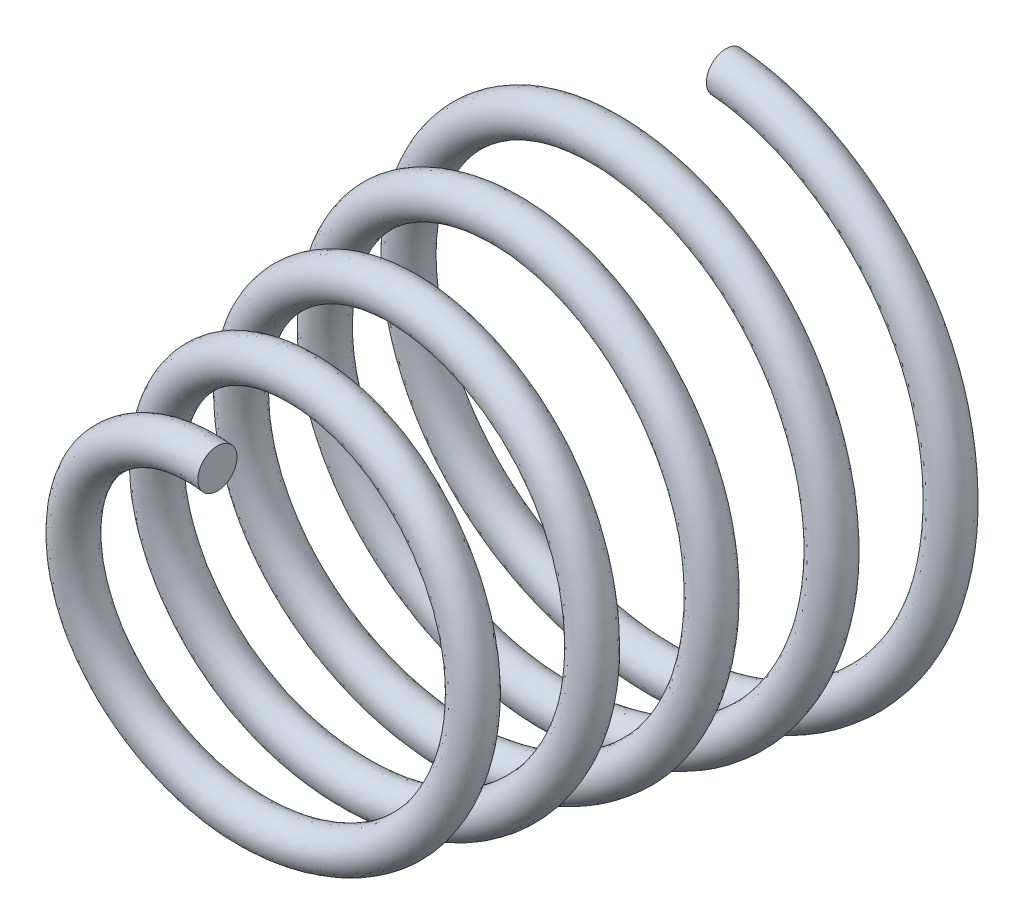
ISO-10303-21;
HEADER;
FILE_DESCRIPTION(('STEP AP214'),'2;1');
FILE_NAME('part.step','',(''),(''),'','','');
FILE_SCHEMA(('AUTOMOTIVE_DESIGN { 1 0 10303 214 1 1 1 1 }'));
ENDSEC;
DATA;
#1=APPLICATION_CONTEXT('core data for automotive mechanical design processes');
#2=APPLICATION_PROTOCOL_DEFINITION('international standard','automotive_design',2000,#1);
#3=PRODUCT_CONTEXT('',#1,'mechanical');
#4=PRODUCT('Part','Part','',(#3));
#5=PRODUCT_RELATED_PRODUCT_CATEGORY('part','',(#4));
#6=PRODUCT_DEFINITION_FORMATION('','',#4);
#7=PRODUCT_DEFINITION_CONTEXT('part definition',#1,'design');
#8=PRODUCT_DEFINITION('design','',#6,#7);
#9=PRODUCT_DEFINITION_SHAPE('','',#8);
#10=(LENGTH_UNIT() NAMED_UNIT(*) SI_UNIT(.MILLI.,.METRE.));
#11=(NAMED_UNIT(*) PLANE_ANGLE_UNIT() SI_UNIT($,.RADIAN.));
#12=(NAMED_UNIT(*) SI_UNIT($,.STERADIAN.) SOLID_ANGLE_UNIT());
#13=UNCERTAINTY_MEASURE_WITH_UNIT(LENGTH_MEASURE(1.E-05),#10,'distance_accuracy_value','');
#14=(GEOMETRIC_REPRESENTATION_CONTEXT(3) GLOBAL_UNCERTAINTY_ASSIGNED_CONTEXT((#13)) GLOBAL_UNIT_ASSIGNED_CONTEXT((#10,
#11,#12)) REPRESENTATION_CONTEXT('',''));
#15=CARTESIAN_POINT('',(0.,0.,0.));
#16=DIRECTION('',(0.,0.,1.));
#17=DIRECTION('',(1.,0.,0.));
#18=AXIS2_PLACEMENT_3D('',#15,#16,#17);
#19=CARTESIAN_POINT('',(0.,3.25116537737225,0.000122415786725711));
#20=DIRECTION('',(1.,0.,0.));
#21=DIRECTION('',(0.,0.,-1.));
#22=AXIS2_PLACEMENT_3D('',#19,#20,#21);
#23=PLANE('',#22);
#24=CARTESIAN_POINT('',(0.,3.25116537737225,0.000122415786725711));
#25=DIRECTION('',(1.,0.,0.));
#26=DIRECTION('',(0.,0.,-1.));
#27=AXIS2_PLACEMENT_3D('',#24,#25,#26);
#28=CIRCLE('',#27,0.25);
#29=CARTESIAN_POINT('',(0.,3.25116537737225,-0.249877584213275));
#30=VERTEX_POINT('',#29);
#31=EDGE_CURVE('E42',#30,#30,#28,.T.);
#32=ORIENTED_EDGE('',*,*,#31,.F.);
#33=EDGE_LOOP('',(#32));
#34=FACE_BOUND('',#33,.T.);
#35=ADVANCED_FACE('F32',(#34),#23,.F.);
#36=CARTESIAN_POINT('',(1.50995920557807E-13,2.10504000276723,6.50012241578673));
#37=DIRECTION('',(1.,0.,0.));
#38=DIRECTION('',(0.,0.,-1.));
#39=AXIS2_PLACEMENT_3D('',#36,#37,#38);
#40=PLANE('',#39);
#41=CARTESIAN_POINT('',(1.50995920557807E-13,2.10504000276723,6.50012241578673));
#42=DIRECTION('',(1.,0.,0.));
#43=DIRECTION('',(0.,0.,-1.));
#44=AXIS2_PLACEMENT_3D('',#41,#42,#43);
#45=CIRCLE('',#44,0.25);
#46=CARTESIAN_POINT('',(1.50995920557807E-13,2.10504000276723,6.25012241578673));
#47=VERTEX_POINT('',#46);
#48=EDGE_CURVE('E11',#47,#47,#45,.T.);
#49=ORIENTED_EDGE('',*,*,#48,.T.);
#50=EDGE_LOOP('',(#49));
#51=FACE_BOUND('',#50,.T.);
#52=ADVANCED_FACE('F49',(#51),#40,.T.);
#53=CARTESIAN_POINT('',(0.,3.25116537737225,-0.249877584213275));
#54=CARTESIAN_POINT('',(1.06394966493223,3.23922626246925,-0.182169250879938));
#55=CARTESIAN_POINT('',(2.09881148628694,2.6678708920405,-0.114460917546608));
#56=CARTESIAN_POINT('',(3.24811841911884,0.904833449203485,0.0209557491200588));
#57=CARTESIAN_POINT('',(3.34671533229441,-0.260030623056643,0.088664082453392));
#58=CARTESIAN_POINT('',(2.52829474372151,-2.17347822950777,0.224080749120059));
#59=CARTESIAN_POINT('',(1.62464478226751,-2.89431578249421,0.291789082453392));
#60=CARTESIAN_POINT('',(-0.398027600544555,-3.27230521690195,0.427205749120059));
#61=CARTESIAN_POINT('',(-1.48689320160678,-2.92522453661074,0.494914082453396));
#62=CARTESIAN_POINT('',(-2.90834071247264,-1.4700093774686,0.630330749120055));
#63=CARTESIAN_POINT('',(-3.22089407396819,-0.384352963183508,0.698039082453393));
#64=CARTESIAN_POINT('',(-2.8052140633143,1.58302039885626,0.833455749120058));
#65=CARTESIAN_POINT('',(-2.0844756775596,2.43593580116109,0.901164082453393));
#66=CARTESIAN_POINT('',(-0.239382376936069,3.17435383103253,1.03658074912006));
#67=CARTESIAN_POINT('',(0.857180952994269,3.05021958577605,1.10428908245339));
#68=CARTESIAN_POINT('',(2.47674096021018,1.93934716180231,1.23970574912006));
#69=CARTESIAN_POINT('',(2.97657270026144,0.970170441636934,1.3074140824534));
#70=CARTESIAN_POINT('',(2.95269536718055,-0.970170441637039,1.44283074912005));
#71=CARTESIAN_POINT('',(2.43071836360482,-1.91266342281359,1.51053908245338));
#72=CARTESIAN_POINT('',(0.823609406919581,-2.95778227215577,1.64595574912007));
#73=CARTESIAN_POINT('',(-0.237009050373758,-3.04611188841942,1.71366408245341));
#74=CARTESIAN_POINT('',(-1.97719820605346,-2.29945729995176,1.84908074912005));
#75=CARTESIAN_POINT('',(-2.63158305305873,-1.47678019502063,1.91678908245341));
#76=CARTESIAN_POINT('',(-2.97298649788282,0.361961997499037,2.05220574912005));
#77=CARTESIAN_POINT('',(-2.65631314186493,1.350588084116,2.11991408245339));
#78=CARTESIAN_POINT('',(-1.33370425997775,2.6394293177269,2.25533074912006));
#79=CARTESIAN_POINT('',(-0.348287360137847,2.92157535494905,2.32303908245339));
#80=CARTESIAN_POINT('',(1.43515581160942,2.5424813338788,2.45845574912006));
#81=CARTESIAN_POINT('',(2.20709835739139,1.88819565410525,2.52616408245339));
#82=CARTESIAN_POINT('',(2.87375038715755,0.216360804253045,2.66158074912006));
#83=CARTESIAN_POINT('',(2.75988343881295,-0.775956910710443,2.72928908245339));
#84=CARTESIAN_POINT('',(1.75319909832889,-2.23958843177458,2.86470574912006));
#85=CARTESIAN_POINT('',(0.876403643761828,-2.6900413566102,2.93241408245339));
#86=CARTESIAN_POINT('',(-0.876403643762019,-2.66616402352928,3.06783074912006));
#87=CARTESIAN_POINT('',(-1.72651535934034,-2.19356583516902,3.13553908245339));
#88=CARTESIAN_POINT('',(-2.66744612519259,-0.742385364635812,3.27095574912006));
#89=CARTESIAN_POINT('',(-2.74550844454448,0.213987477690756,3.33866408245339));
#90=CARTESIAN_POINT('',(-2.07061985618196,1.78091818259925,3.47408074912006));
#91=CARTESIAN_POINT('',(-1.32891560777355,2.36885032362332,3.54178908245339));
#92=CARTESIAN_POINT('',(0.325896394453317,2.67366777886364,3.67720574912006));
#93=CARTESIAN_POINT('',(1.21428296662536,2.38740174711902,3.74491408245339));
#94=CARTESIAN_POINT('',(2.370517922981,1.19739914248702,3.88033074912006));
#95=CARTESIAN_POINT('',(2.6222566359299,0.312221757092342,3.94803908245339));
#96=CARTESIAN_POINT('',(2.2797486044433,-1.28729122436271,4.08345574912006));
#97=CARTESIAN_POINT('',(1.6919156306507,-1.97826091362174,4.15116408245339));
#98=CARTESIAN_POINT('',(0.193339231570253,-2.57314694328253,4.28658074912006));
#99=CARTESIAN_POINT('',(-0.69473286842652,-2.46954729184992,4.35428908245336));
#100=CARTESIAN_POINT('',(-2.00243590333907,-1.56705103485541,4.48970574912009));
#101=CARTESIAN_POINT('',(-2.40351001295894,-0.782636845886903,4.55741408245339));
#102=CARTESIAN_POINT('',(-2.37963267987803,0.782636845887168,4.69283074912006));
#103=CARTESIAN_POINT('',(-1.95641330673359,1.54036729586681,4.76053908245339));
#104=CARTESIAN_POINT('',(-0.661161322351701,2.37710997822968,4.89595574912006));
#105=CARTESIAN_POINT('',(0.190965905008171,2.44490500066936,4.96366408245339));
#106=CARTESIAN_POINT('',(1.58463815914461,1.84178241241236,5.09908074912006));
#107=CARTESIAN_POINT('',(2.10611759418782,1.18105102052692,5.16678908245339));
#108=CARTESIAN_POINT('',(2.37434905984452,-0.289830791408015,5.30220574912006));
#109=CARTESIAN_POINT('',(2.11849035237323,-1.07797784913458,5.36991408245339));
#110=CARTESIAN_POINT('',(1.06109402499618,-2.10160652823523,5.50533074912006));
#111=CARTESIAN_POINT('',(0.276156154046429,-2.32293791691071,5.57303908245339));
#112=CARTESIAN_POINT('',(-1.13942663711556,-2.01701587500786,5.70845574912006));
#113=CARTESIAN_POINT('',(-1.74942346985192,-1.49563560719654,5.77616408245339));
#114=CARTESIAN_POINT('',(-2.27254349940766,-0.170317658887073,5.91158074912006));
#115=CARTESIAN_POINT('',(-2.17921114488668,0.613508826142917,5.97928908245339));
#116=CARTESIAN_POINT('',(-1.38090297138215,1.76528337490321,6.11470574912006));
#117=CARTESIAN_POINT('',(-0.688878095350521,2.11697906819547,6.18241408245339));
#118=CARTESIAN_POINT('',(1.50995920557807E-13,2.10504000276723,6.25012241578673));
#119=CARTESIAN_POINT('',(0.,3.75116537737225,-0.249877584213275));
#120=CARTESIAN_POINT('',(1.22757555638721,3.73922625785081,-0.182169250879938));
#121=CARTESIAN_POINT('',(2.42364167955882,3.08170437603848,-0.114460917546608));
#122=CARTESIAN_POINT('',(3.75475783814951,1.0465701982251,0.0209557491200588));
#123=CARTESIAN_POINT('',(3.87127128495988,-0.300203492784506,0.088664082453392));
#124=CARTESIAN_POINT('',(2.92761832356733,-2.515988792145,0.224080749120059));
#125=CARTESIAN_POINT('',(1.88266993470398,-3.35278696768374,0.291789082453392));
#126=CARTESIAN_POINT('',(-0.460962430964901,-3.79461931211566,0.427205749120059));
#127=CARTESIAN_POINT('',(-1.72474696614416,-3.39447755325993,0.494914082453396));
#128=CARTESIAN_POINT('',(-3.37759372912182,-1.70786314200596,0.630330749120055));
#129=CARTESIAN_POINT('',(-3.7432081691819,-0.447287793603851,0.698039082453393));
#130=CARTESIAN_POINT('',(-3.26368524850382,1.84104555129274,0.833455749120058));
#131=CARTESIAN_POINT('',(-2.42698624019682,2.83525938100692,0.901164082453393));
#132=CARTESIAN_POINT('',(-0.279555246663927,3.698909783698,1.03658074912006));
#133=CARTESIAN_POINT('',(0.998917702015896,3.55685900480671,1.10428908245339));
#134=CARTESIAN_POINT('',(2.89057444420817,2.26417735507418,1.23970574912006));
#135=CARTESIAN_POINT('',(3.47657270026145,1.13379442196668,1.3074140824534));
#136=CARTESIAN_POINT('',(3.45269536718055,-1.13379442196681,1.44283074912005));
#137=CARTESIAN_POINT('',(2.8445518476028,-2.23749361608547,1.51053908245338));
#138=CARTESIAN_POINT('',(0.965346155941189,-3.46442169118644,1.64595574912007));
#139=CARTESIAN_POINT('',(-0.277181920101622,-3.57066784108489,1.71366408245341));
#140=CARTESIAN_POINT('',(-2.31970876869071,-2.69878087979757,1.84908074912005));
#141=CARTESIAN_POINT('',(-3.09005423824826,-1.7348053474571,1.91678908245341));
#142=CARTESIAN_POINT('',(-3.49530059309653,0.4248968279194,2.05220574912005));
#143=CARTESIAN_POINT('',(-3.1255661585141,1.58844184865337,2.11991408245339));
#144=CARTESIAN_POINT('',(-1.57155802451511,3.1086823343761,2.25533074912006));
#145=CARTESIAN_POINT('',(-0.41122219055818,3.44388945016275,2.32303908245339));
#146=CARTESIAN_POINT('',(1.69318096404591,3.00095251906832,2.45845574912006));
#147=CARTESIAN_POINT('',(2.60642193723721,2.23070621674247,2.52616408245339));
#148=CARTESIAN_POINT('',(3.39830633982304,0.256533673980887,2.66158074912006));
#149=CARTESIAN_POINT('',(3.26652285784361,-0.917693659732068,2.72928908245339));
#150=CARTESIAN_POINT('',(2.07802929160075,-2.65342191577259,2.86470574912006));
#151=CARTESIAN_POINT('',(1.04002762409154,-3.19004135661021,2.93241408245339));
#152=CARTESIAN_POINT('',(-1.04002762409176,-3.16616402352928,3.06783074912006));
#153=CARTESIAN_POINT('',(-2.05134555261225,-2.60739931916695,3.13553908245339));
#154=CARTESIAN_POINT('',(-3.17408554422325,-0.884122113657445,3.27095574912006));
#155=CARTESIAN_POINT('',(-3.27006439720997,0.254160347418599,3.33866408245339));
#156=CARTESIAN_POINT('',(-2.46994343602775,2.12342874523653,3.47408074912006));
#157=CARTESIAN_POINT('',(-1.58694076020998,2.82732150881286,3.54178908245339));
#158=CARTESIAN_POINT('',(0.38883122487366,3.19598187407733,3.67720574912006));
#159=CARTESIAN_POINT('',(1.45213673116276,2.85665476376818,3.74491408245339));
#160=CARTESIAN_POINT('',(2.83977093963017,1.43525290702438,3.88033074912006));
#161=CARTESIAN_POINT('',(3.1445707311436,0.375156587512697,3.94803908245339));
#162=CARTESIAN_POINT('',(2.73821978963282,-1.54531637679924,4.08345574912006));
#163=CARTESIAN_POINT('',(2.03442619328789,-2.37758449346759,4.15116408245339));
#164=CARTESIAN_POINT('',(0.233512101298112,-3.09770289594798,4.28658074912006));
#165=CARTESIAN_POINT('',(-0.836469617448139,-2.9761867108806,4.35428908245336));
#166=CARTESIAN_POINT('',(-2.41626938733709,-1.89188122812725,4.48970574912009));
#167=CARTESIAN_POINT('',(-2.90351001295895,-0.946260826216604,4.55741408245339));
#168=CARTESIAN_POINT('',(-2.87963267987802,0.946260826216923,4.69283074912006));
#169=CARTESIAN_POINT('',(-2.37024679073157,1.86519748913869,4.76053908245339));
#170=CARTESIAN_POINT('',(-0.802898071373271,2.88374939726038,4.89595574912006));
#171=CARTESIAN_POINT('',(0.231138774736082,2.96946095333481,4.96366408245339));
#172=CARTESIAN_POINT('',(1.92714872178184,2.24110599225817,5.09908074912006));
#173=CARTESIAN_POINT('',(2.56458877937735,1.43907617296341,5.16678908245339));
#174=CARTESIAN_POINT('',(2.89666315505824,-0.352765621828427,5.30220574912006));
#175=CARTESIAN_POINT('',(2.58774336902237,-1.31583161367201,5.36991408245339));
#176=CARTESIAN_POINT('',(1.29894778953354,-2.5708595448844,5.50533074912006));
#177=CARTESIAN_POINT('',(0.339090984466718,-2.84525201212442,5.57303908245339));
#178=CARTESIAN_POINT('',(-1.39745178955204,-2.47548706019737,5.70845574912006));
#179=CARTESIAN_POINT('',(-2.14874704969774,-1.83814616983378,5.77616408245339));
#180=CARTESIAN_POINT('',(-2.79709945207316,-0.210490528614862,5.91158074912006));
#181=CARTESIAN_POINT('',(-2.68585056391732,0.755245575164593,5.97928908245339));
#182=CARTESIAN_POINT('',(-1.70573316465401,2.17911685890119,6.11470574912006));
#183=CARTESIAN_POINT('',(-0.852503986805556,2.61697906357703,6.18241408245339));
#184=CARTESIAN_POINT('',(1.85910754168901E-13,2.60504000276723,6.25012241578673));
#185=CARTESIAN_POINT('',(0.,3.75116537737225,0.250122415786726));
#186=CARTESIAN_POINT('',(1.22757555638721,3.73922625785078,0.317830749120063));
#187=CARTESIAN_POINT('',(2.42364167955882,3.08170437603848,0.385539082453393));
#188=CARTESIAN_POINT('',(3.75475783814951,1.04657019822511,0.520955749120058));
#189=CARTESIAN_POINT('',(3.87127128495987,-0.300203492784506,0.588664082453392));
#190=CARTESIAN_POINT('',(2.92761832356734,-2.515988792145,0.724080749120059));
#191=CARTESIAN_POINT('',(1.88266993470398,-3.35278696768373,0.791789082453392));
#192=CARTESIAN_POINT('',(-0.460962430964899,-3.79461931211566,0.927205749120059));
#193=CARTESIAN_POINT('',(-1.72474696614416,-3.39447755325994,0.994914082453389));
#194=CARTESIAN_POINT('',(-3.37759372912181,-1.70786314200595,1.13033074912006));
#195=CARTESIAN_POINT('',(-3.7432081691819,-0.447287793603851,1.19803908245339));
#196=CARTESIAN_POINT('',(-3.26368524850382,1.84104555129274,1.33345574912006));
#197=CARTESIAN_POINT('',(-2.42698624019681,2.8352593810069,1.40116408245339));
#198=CARTESIAN_POINT('',(-0.279555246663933,3.69890978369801,1.53658074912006));
#199=CARTESIAN_POINT('',(0.998917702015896,3.55685900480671,1.60428908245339));
#200=CARTESIAN_POINT('',(2.89057444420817,2.26417735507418,1.73970574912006));
#201=CARTESIAN_POINT('',(3.47657270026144,1.13379442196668,1.80741408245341));
#202=CARTESIAN_POINT('',(3.45269536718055,-1.13379442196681,1.94283074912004));
#203=CARTESIAN_POINT('',(2.84455184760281,-2.23749361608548,2.01053908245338));
#204=CARTESIAN_POINT('',(0.965346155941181,-3.46442169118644,2.14595574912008));
#205=CARTESIAN_POINT('',(-0.277181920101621,-3.57066784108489,2.21366408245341));
#206=CARTESIAN_POINT('',(-2.31970876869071,-2.69878087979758,2.34908074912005));
#207=CARTESIAN_POINT('',(-3.09005423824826,-1.7348053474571,2.41678908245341));
#208=CARTESIAN_POINT('',(-3.49530059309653,0.4248968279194,2.55220574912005));
#209=CARTESIAN_POINT('',(-3.12556615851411,1.58844184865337,2.61991408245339));
#210=CARTESIAN_POINT('',(-1.57155802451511,3.1086823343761,2.75533074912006));
#211=CARTESIAN_POINT('',(-0.411222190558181,3.44388945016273,2.82303908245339));
#212=CARTESIAN_POINT('',(1.69318096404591,3.00095251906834,2.95845574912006));
#213=CARTESIAN_POINT('',(2.6064219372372,2.23070621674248,3.02616408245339));
#214=CARTESIAN_POINT('',(3.39830633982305,0.256533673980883,3.16158074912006));
#215=CARTESIAN_POINT('',(3.26652285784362,-0.917693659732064,3.22928908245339));
#216=CARTESIAN_POINT('',(2.07802929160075,-2.65342191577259,3.36470574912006));
#217=CARTESIAN_POINT('',(1.04002762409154,-3.1900413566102,3.43241408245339));
#218=CARTESIAN_POINT('',(-1.04002762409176,-3.16616402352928,3.56783074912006));
#219=CARTESIAN_POINT('',(-2.05134555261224,-2.60739931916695,3.63553908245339));
#220=CARTESIAN_POINT('',(-3.17408554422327,-0.884122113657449,3.77095574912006));
#221=CARTESIAN_POINT('',(-3.27006439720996,0.254160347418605,3.83866408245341));
#222=CARTESIAN_POINT('',(-2.46994343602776,2.12342874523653,3.97408074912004));
#223=CARTESIAN_POINT('',(-1.58694076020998,2.82732150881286,4.04178908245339));
#224=CARTESIAN_POINT('',(0.38883122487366,3.19598187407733,4.17720574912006));
#225=CARTESIAN_POINT('',(1.45213673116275,2.85665476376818,4.24491408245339));
#226=CARTESIAN_POINT('',(2.83977093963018,1.43525290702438,4.38033074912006));
#227=CARTESIAN_POINT('',(3.1445707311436,0.375156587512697,4.44803908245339));
#228=CARTESIAN_POINT('',(2.73821978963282,-1.54531637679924,4.58345574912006));
#229=CARTESIAN_POINT('',(2.03442619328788,-2.37758449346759,4.65116408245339));
#230=CARTESIAN_POINT('',(0.233512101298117,-3.09770289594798,4.78658074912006));
#231=CARTESIAN_POINT('',(-0.836469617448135,-2.9761867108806,4.85428908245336));
#232=CARTESIAN_POINT('',(-2.4162693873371,-1.89188122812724,4.98970574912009));
#233=CARTESIAN_POINT('',(-2.90351001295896,-0.946260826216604,5.05741408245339));
#234=CARTESIAN_POINT('',(-2.87963267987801,0.946260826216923,5.19283074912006));
#235=CARTESIAN_POINT('',(-2.37024679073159,1.86519748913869,5.26053908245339));
#236=CARTESIAN_POINT('',(-0.802898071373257,2.88374939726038,5.39595574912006));
#237=CARTESIAN_POINT('',(0.231138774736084,2.96946095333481,5.46366408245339));
#238=CARTESIAN_POINT('',(1.92714872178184,2.24110599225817,5.59908074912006));
#239=CARTESIAN_POINT('',(2.56458877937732,1.43907617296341,5.66678908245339));
#240=CARTESIAN_POINT('',(2.89666315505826,-0.352765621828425,5.80220574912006));
#241=CARTESIAN_POINT('',(2.58774336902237,-1.31583161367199,5.86991408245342));
#242=CARTESIAN_POINT('',(1.29894778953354,-2.57085954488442,6.00533074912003));
#243=CARTESIAN_POINT('',(0.339090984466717,-2.84525201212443,6.07303908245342));
#244=CARTESIAN_POINT('',(-1.39745178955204,-2.47548706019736,6.20845574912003));
#245=CARTESIAN_POINT('',(-2.14874704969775,-1.83814616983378,6.27616408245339));
#246=CARTESIAN_POINT('',(-2.79709945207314,-0.210490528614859,6.41158074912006));
#247=CARTESIAN_POINT('',(-2.68585056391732,0.75524557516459,6.47928908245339));
#248=CARTESIAN_POINT('',(-1.70573316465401,2.17911685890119,6.61470574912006));
#249=CARTESIAN_POINT('',(-0.852503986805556,2.61697906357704,6.68241408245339));
#250=CARTESIAN_POINT('',(1.85910754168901E-13,2.60504000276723,6.75012241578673));
#251=CARTESIAN_POINT('',(0.,3.25116537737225,0.250122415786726));
#252=CARTESIAN_POINT('',(1.06394966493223,3.23922626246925,0.317830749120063));
#253=CARTESIAN_POINT('',(2.09881148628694,2.6678708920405,0.385539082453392));
#254=CARTESIAN_POINT('',(3.24811841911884,0.904833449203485,0.52095574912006));
#255=CARTESIAN_POINT('',(3.34671533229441,-0.260030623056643,0.588664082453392));
#256=CARTESIAN_POINT('',(2.52829474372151,-2.17347822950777,0.724080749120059));
#257=CARTESIAN_POINT('',(1.62464478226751,-2.89431578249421,0.791789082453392));
#258=CARTESIAN_POINT('',(-0.398027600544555,-3.27230521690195,0.927205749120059));
#259=CARTESIAN_POINT('',(-1.48689320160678,-2.92522453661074,0.994914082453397));
#260=CARTESIAN_POINT('',(-2.90834071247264,-1.4700093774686,1.13033074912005));
#261=CARTESIAN_POINT('',(-3.22089407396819,-0.384352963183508,1.19803908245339));
#262=CARTESIAN_POINT('',(-2.8052140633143,1.58302039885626,1.33345574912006));
#263=CARTESIAN_POINT('',(-2.0844756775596,2.43593580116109,1.40116408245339));
#264=CARTESIAN_POINT('',(-0.239382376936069,3.17435383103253,1.53658074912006));
#265=CARTESIAN_POINT('',(0.857180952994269,3.05021958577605,1.60428908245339));
#266=CARTESIAN_POINT('',(2.47674096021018,1.93934716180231,1.73970574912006));
#267=CARTESIAN_POINT('',(2.97657270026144,0.970170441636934,1.8074140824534));
#268=CARTESIAN_POINT('',(2.95269536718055,-0.970170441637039,1.94283074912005));
#269=CARTESIAN_POINT('',(2.43071836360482,-1.91266342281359,2.01053908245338));
#270=CARTESIAN_POINT('',(0.823609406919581,-2.95778227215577,2.14595574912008));
#271=CARTESIAN_POINT('',(-0.237009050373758,-3.04611188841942,2.21366408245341));
#272=CARTESIAN_POINT('',(-1.97719820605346,-2.29945729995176,2.34908074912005));
#273=CARTESIAN_POINT('',(-2.63158305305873,-1.47678019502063,2.41678908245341));
#274=CARTESIAN_POINT('',(-2.97298649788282,0.361961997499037,2.55220574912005));
#275=CARTESIAN_POINT('',(-2.65631314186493,1.350588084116,2.61991408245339));
#276=CARTESIAN_POINT('',(-1.33370425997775,2.6394293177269,2.75533074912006));
#277=CARTESIAN_POINT('',(-0.348287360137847,2.92157535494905,2.82303908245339));
#278=CARTESIAN_POINT('',(1.43515581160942,2.5424813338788,2.95845574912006));
#279=CARTESIAN_POINT('',(2.20709835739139,1.88819565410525,3.02616408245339));
#280=CARTESIAN_POINT('',(2.87375038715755,0.216360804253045,3.16158074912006));
#281=CARTESIAN_POINT('',(2.75988343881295,-0.775956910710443,3.22928908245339));
#282=CARTESIAN_POINT('',(1.75319909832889,-2.23958843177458,3.36470574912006));
#283=CARTESIAN_POINT('',(0.876403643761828,-2.6900413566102,3.43241408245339));
#284=CARTESIAN_POINT('',(-0.876403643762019,-2.66616402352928,3.56783074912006));
#285=CARTESIAN_POINT('',(-1.72651535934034,-2.19356583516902,3.63553908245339));
#286=CARTESIAN_POINT('',(-2.66744612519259,-0.742385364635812,3.77095574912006));
#287=CARTESIAN_POINT('',(-2.74550844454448,0.213987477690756,3.83866408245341));
#288=CARTESIAN_POINT('',(-2.07061985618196,1.78091818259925,3.97408074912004));
#289=CARTESIAN_POINT('',(-1.32891560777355,2.36885032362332,4.04178908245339));
#290=CARTESIAN_POINT('',(0.325896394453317,2.67366777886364,4.17720574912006));
#291=CARTESIAN_POINT('',(1.21428296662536,2.38740174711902,4.24491408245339));
#292=CARTESIAN_POINT('',(2.370517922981,1.19739914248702,4.38033074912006));
#293=CARTESIAN_POINT('',(2.6222566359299,0.312221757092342,4.44803908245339));
#294=CARTESIAN_POINT('',(2.2797486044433,-1.28729122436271,4.58345574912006));
#295=CARTESIAN_POINT('',(1.6919156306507,-1.97826091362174,4.65116408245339));
#296=CARTESIAN_POINT('',(0.193339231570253,-2.57314694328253,4.78658074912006));
#297=CARTESIAN_POINT('',(-0.69473286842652,-2.46954729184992,4.85428908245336));
#298=CARTESIAN_POINT('',(-2.00243590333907,-1.56705103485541,4.98970574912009));
#299=CARTESIAN_POINT('',(-2.40351001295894,-0.782636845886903,5.05741408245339));
#300=CARTESIAN_POINT('',(-2.37963267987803,0.782636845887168,5.19283074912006));
#301=CARTESIAN_POINT('',(-1.95641330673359,1.54036729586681,5.26053908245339));
#302=CARTESIAN_POINT('',(-0.661161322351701,2.37710997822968,5.39595574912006));
#303=CARTESIAN_POINT('',(0.190965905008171,2.44490500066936,5.46366408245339));
#304=CARTESIAN_POINT('',(1.58463815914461,1.84178241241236,5.59908074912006));
#305=CARTESIAN_POINT('',(2.10611759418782,1.18105102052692,5.66678908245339));
#306=CARTESIAN_POINT('',(2.37434905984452,-0.289830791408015,5.80220574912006));
#307=CARTESIAN_POINT('',(2.11849035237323,-1.07797784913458,5.86991408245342));
#308=CARTESIAN_POINT('',(1.06109402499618,-2.10160652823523,6.00533074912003));
#309=CARTESIAN_POINT('',(0.276156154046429,-2.32293791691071,6.07303908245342));
#310=CARTESIAN_POINT('',(-1.13942663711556,-2.01701587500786,6.20845574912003));
#311=CARTESIAN_POINT('',(-1.74942346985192,-1.49563560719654,6.27616408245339));
#312=CARTESIAN_POINT('',(-2.27254349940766,-0.170317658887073,6.41158074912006));
#313=CARTESIAN_POINT('',(-2.17921114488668,0.613508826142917,6.47928908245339));
#314=CARTESIAN_POINT('',(-1.38090297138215,1.76528337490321,6.61470574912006));
#315=CARTESIAN_POINT('',(-0.688878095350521,2.11697906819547,6.68241408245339));
#316=CARTESIAN_POINT('',(1.50995920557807E-13,2.10504000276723,6.75012241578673));
#317=CARTESIAN_POINT('',(0.,2.75116537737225,0.250122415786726));
#318=CARTESIAN_POINT('',(0.900323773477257,2.73922626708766,0.317830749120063));
#319=CARTESIAN_POINT('',(1.77398129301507,2.25403740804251,0.385539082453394));
#320=CARTESIAN_POINT('',(2.74147900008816,0.763096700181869,0.520955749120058));
#321=CARTESIAN_POINT('',(2.82215937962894,-0.21985775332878,0.588664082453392));
#322=CARTESIAN_POINT('',(2.1289711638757,-1.83096766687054,0.724080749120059));
#323=CARTESIAN_POINT('',(1.36661962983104,-2.43584459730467,0.791789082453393));
#324=CARTESIAN_POINT('',(-0.335092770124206,-2.74999112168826,0.92720574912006));
#325=CARTESIAN_POINT('',(-1.24903943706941,-2.45597151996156,0.994914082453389));
#326=CARTESIAN_POINT('',(-2.43908769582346,-1.23215561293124,1.13033074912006));
#327=CARTESIAN_POINT('',(-2.69857997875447,-0.321418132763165,1.19803908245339));
#328=CARTESIAN_POINT('',(-2.34674287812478,1.32499524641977,1.33345574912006));
#329=CARTESIAN_POINT('',(-1.74196511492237,2.03661222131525,1.40116408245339));
#330=CARTESIAN_POINT('',(-0.199209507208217,2.64979787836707,1.53658074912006));
#331=CARTESIAN_POINT('',(0.715444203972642,2.54358016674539,1.60428908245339));
#332=CARTESIAN_POINT('',(2.06290747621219,1.61451696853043,1.73970574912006));
#333=CARTESIAN_POINT('',(2.47657270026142,0.806546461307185,1.8074140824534));
#334=CARTESIAN_POINT('',(2.45269536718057,-0.806546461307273,1.94283074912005));
#335=CARTESIAN_POINT('',(2.01688487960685,-1.58783322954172,2.01053908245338));
#336=CARTESIAN_POINT('',(0.681872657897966,-2.45114285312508,2.14595574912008));
#337=CARTESIAN_POINT('',(-0.196836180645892,-2.52155593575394,2.21366408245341));
#338=CARTESIAN_POINT('',(-1.63468764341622,-1.90013372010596,2.34908074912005));
#339=CARTESIAN_POINT('',(-2.17311186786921,-1.21875504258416,2.41678908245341));
#340=CARTESIAN_POINT('',(-2.45067240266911,0.299027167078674,2.55220574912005));
#341=CARTESIAN_POINT('',(-2.18706012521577,1.11273431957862,2.61991408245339));
#342=CARTESIAN_POINT('',(-1.09585049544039,2.17017630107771,2.75533074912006));
#343=CARTESIAN_POINT('',(-0.285352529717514,2.39926125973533,2.82303908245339));
#344=CARTESIAN_POINT('',(1.17713065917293,2.08401014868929,2.95845574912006));
#345=CARTESIAN_POINT('',(1.80777477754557,1.54568509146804,3.02616408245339));
#346=CARTESIAN_POINT('',(2.34919443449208,0.176187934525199,3.16158074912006));
#347=CARTESIAN_POINT('',(2.25324401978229,-0.634220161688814,3.22928908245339));
#348=CARTESIAN_POINT('',(1.42836890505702,-1.82575494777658,3.36470574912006));
#349=CARTESIAN_POINT('',(0.712779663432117,-2.19004135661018,3.43241408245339));
#350=CARTESIAN_POINT('',(-0.712779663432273,-2.1661640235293,3.56783074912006));
#351=CARTESIAN_POINT('',(-1.40168516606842,-1.77973235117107,3.63553908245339));
#352=CARTESIAN_POINT('',(-2.16080670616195,-0.600648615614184,3.77095574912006));
#353=CARTESIAN_POINT('',(-2.22095249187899,0.173814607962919,3.83866408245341));
#354=CARTESIAN_POINT('',(-1.67129627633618,1.43840761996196,3.97408074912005));
#355=CARTESIAN_POINT('',(-1.07089045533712,1.91037913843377,4.04178908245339));
#356=CARTESIAN_POINT('',(0.262961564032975,2.15135368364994,4.17720574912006));
#357=CARTESIAN_POINT('',(0.97642920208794,1.91814873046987,4.24491408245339));
#358=CARTESIAN_POINT('',(1.90126490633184,0.959545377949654,4.38033074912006));
#359=CARTESIAN_POINT('',(2.0999425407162,0.249286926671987,4.44803908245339));
#360=CARTESIAN_POINT('',(1.82127741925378,-1.02926607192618,4.58345574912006));
#361=CARTESIAN_POINT('',(1.34940506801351,-1.57893733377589,4.65116408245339));
#362=CARTESIAN_POINT('',(0.1531663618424,-2.04859099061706,4.78658074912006));
#363=CARTESIAN_POINT('',(-0.552996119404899,-1.96290787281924,4.85428908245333));
#364=CARTESIAN_POINT('',(-1.58860241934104,-1.24222084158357,4.98970574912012));
#365=CARTESIAN_POINT('',(-1.90351001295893,-0.619012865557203,5.05741408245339));
#366=CARTESIAN_POINT('',(-1.87963267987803,0.619012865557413,5.19283074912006));
#367=CARTESIAN_POINT('',(-1.54257982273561,1.21553710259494,5.26053908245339));
#368=CARTESIAN_POINT('',(-0.519424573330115,1.87047055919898,5.39595574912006));
#369=CARTESIAN_POINT('',(0.150793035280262,1.9203490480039,5.46366408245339));
#370=CARTESIAN_POINT('',(1.24212759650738,1.44245883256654,5.59908074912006));
#371=CARTESIAN_POINT('',(1.64764640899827,0.923025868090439,5.66678908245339));
#372=CARTESIAN_POINT('',(1.85203496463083,-0.226895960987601,5.80220574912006));
#373=CARTESIAN_POINT('',(1.64923733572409,-0.840124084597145,5.86991408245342));
#374=CARTESIAN_POINT('',(0.823240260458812,-1.63235351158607,6.00533074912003));
#375=CARTESIAN_POINT('',(0.21322132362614,-1.80062382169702,6.07303908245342));
#376=CARTESIAN_POINT('',(-0.881401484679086,-1.55854468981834,6.20845574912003));
#377=CARTESIAN_POINT('',(-1.35009989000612,-1.1531250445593,6.27616408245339));
#378=CARTESIAN_POINT('',(-1.74798754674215,-0.13014478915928,6.41158074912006));
#379=CARTESIAN_POINT('',(-1.67257172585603,0.471772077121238,6.47928908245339));
#380=CARTESIAN_POINT('',(-1.05607277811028,1.35144989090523,6.61470574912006));
#381=CARTESIAN_POINT('',(-0.525252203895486,1.61697907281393,6.68241408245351));
#382=CARTESIAN_POINT('',(1.16081086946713E-13,1.60504000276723,6.75012241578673));
#383=CARTESIAN_POINT('',(0.,2.75116537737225,-0.249877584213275));
#384=CARTESIAN_POINT('',(0.900323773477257,2.73922626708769,-0.182169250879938));
#385=CARTESIAN_POINT('',(1.77398129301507,2.25403740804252,-0.114460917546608));
#386=CARTESIAN_POINT('',(2.74147900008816,0.763096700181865,0.0209557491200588));
#387=CARTESIAN_POINT('',(2.82215937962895,-0.21985775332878,0.088664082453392));
#388=CARTESIAN_POINT('',(2.1289711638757,-1.83096766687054,0.224080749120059));
#389=CARTESIAN_POINT('',(1.36661962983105,-2.43584459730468,0.291789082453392));
#390=CARTESIAN_POINT('',(-0.335092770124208,-2.74999112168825,0.427205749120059));
#391=CARTESIAN_POINT('',(-1.2490394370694,-2.45597151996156,0.494914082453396));
#392=CARTESIAN_POINT('',(-2.43908769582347,-1.23215561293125,0.630330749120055));
#393=CARTESIAN_POINT('',(-2.69857997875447,-0.321418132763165,0.698039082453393));
#394=CARTESIAN_POINT('',(-2.34674287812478,1.32499524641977,0.833455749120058));
#395=CARTESIAN_POINT('',(-1.74196511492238,2.03661222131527,0.901164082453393));
#396=CARTESIAN_POINT('',(-0.199209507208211,2.64979787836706,1.03658074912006));
#397=CARTESIAN_POINT('',(0.715444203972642,2.54358016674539,1.10428908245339));
#398=CARTESIAN_POINT('',(2.06290747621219,1.61451696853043,1.23970574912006));
#399=CARTESIAN_POINT('',(2.47657270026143,0.806546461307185,1.3074140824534));
#400=CARTESIAN_POINT('',(2.45269536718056,-0.806546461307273,1.44283074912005));
#401=CARTESIAN_POINT('',(2.01688487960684,-1.58783322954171,1.51053908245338));
#402=CARTESIAN_POINT('',(0.681872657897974,-2.45114285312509,1.64595574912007));
#403=CARTESIAN_POINT('',(-0.196836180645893,-2.52155593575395,1.71366408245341));
#404=CARTESIAN_POINT('',(-1.63468764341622,-1.90013372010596,1.84908074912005));
#405=CARTESIAN_POINT('',(-2.17311186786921,-1.21875504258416,1.91678908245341));
#406=CARTESIAN_POINT('',(-2.45067240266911,0.299027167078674,2.05220574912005));
#407=CARTESIAN_POINT('',(-2.18706012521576,1.11273431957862,2.11991408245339));
#408=CARTESIAN_POINT('',(-1.09585049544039,2.17017630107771,2.25533074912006));
#409=CARTESIAN_POINT('',(-0.285352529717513,2.39926125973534,2.32303908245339));
#410=CARTESIAN_POINT('',(1.17713065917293,2.08401014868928,2.45845574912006));
#411=CARTESIAN_POINT('',(1.80777477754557,1.54568509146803,2.52616408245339));
#412=CARTESIAN_POINT('',(2.34919443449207,0.176187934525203,2.66158074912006));
#413=CARTESIAN_POINT('',(2.25324401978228,-0.634220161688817,2.72928908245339));
#414=CARTESIAN_POINT('',(1.42836890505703,-1.82575494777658,2.86470574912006));
#415=CARTESIAN_POINT('',(0.712779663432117,-2.19004135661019,2.93241408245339));
#416=CARTESIAN_POINT('',(-0.712779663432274,-2.16616402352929,3.06783074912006));
#417=CARTESIAN_POINT('',(-1.40168516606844,-1.77973235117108,3.13553908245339));
#418=CARTESIAN_POINT('',(-2.16080670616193,-0.60064861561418,3.27095574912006));
#419=CARTESIAN_POINT('',(-2.220952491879,0.173814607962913,3.33866408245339));
#420=CARTESIAN_POINT('',(-1.67129627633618,1.43840761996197,3.47408074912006));
#421=CARTESIAN_POINT('',(-1.07089045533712,1.91037913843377,3.54178908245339));
#422=CARTESIAN_POINT('',(0.262961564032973,2.15135368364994,3.67720574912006));
#423=CARTESIAN_POINT('',(0.976429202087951,1.91814873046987,3.74491408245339));
#424=CARTESIAN_POINT('',(1.90126490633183,0.959545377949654,3.88033074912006));
#425=CARTESIAN_POINT('',(2.0999425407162,0.249286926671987,3.94803908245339));
#426=CARTESIAN_POINT('',(1.82127741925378,-1.02926607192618,4.08345574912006));
#427=CARTESIAN_POINT('',(1.34940506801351,-1.57893733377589,4.15116408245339));
#428=CARTESIAN_POINT('',(0.153166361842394,-2.04859099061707,4.28658074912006));
#429=CARTESIAN_POINT('',(-0.552996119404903,-1.96290787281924,4.35428908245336));
#430=CARTESIAN_POINT('',(-1.58860241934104,-1.24222084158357,4.48970574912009));
#431=CARTESIAN_POINT('',(-1.90351001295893,-0.619012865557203,4.55741408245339));
#432=CARTESIAN_POINT('',(-1.87963267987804,0.619012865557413,4.69283074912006));
#433=CARTESIAN_POINT('',(-1.5425798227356,1.21553710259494,4.76053908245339));
#434=CARTESIAN_POINT('',(-0.51942457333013,1.87047055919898,4.89595574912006));
#435=CARTESIAN_POINT('',(0.150793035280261,1.9203490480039,4.96366408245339));
#436=CARTESIAN_POINT('',(1.24212759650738,1.44245883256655,5.09908074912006));
#437=CARTESIAN_POINT('',(1.64764640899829,0.923025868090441,5.16678908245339));
#438=CARTESIAN_POINT('',(1.8520349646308,-0.226895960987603,5.30220574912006));
#439=CARTESIAN_POINT('',(1.64923733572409,-0.840124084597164,5.36991408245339));
#440=CARTESIAN_POINT('',(0.823240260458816,-1.63235351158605,5.50533074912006));
#441=CARTESIAN_POINT('',(0.21322132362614,-1.80062382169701,5.57303908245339));
#442=CARTESIAN_POINT('',(-0.881401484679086,-1.55854468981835,5.70845574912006));
#443=CARTESIAN_POINT('',(-1.3500998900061,-1.1531250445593,5.77616408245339));
#444=CARTESIAN_POINT('',(-1.74798754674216,-0.130144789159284,5.91158074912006));
#445=CARTESIAN_POINT('',(-1.67257172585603,0.471772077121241,5.97928908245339));
#446=CARTESIAN_POINT('',(-1.05607277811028,1.35144989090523,6.11470574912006));
#447=CARTESIAN_POINT('',(-0.525252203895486,1.61697907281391,6.18241408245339));
#448=CARTESIAN_POINT('',(1.16081086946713E-13,1.60504000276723,6.25012241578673));
#449=CARTESIAN_POINT('',(0.,3.25116537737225,-0.249877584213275));
#450=CARTESIAN_POINT('',(1.06394966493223,3.23922626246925,-0.182169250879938));
#451=CARTESIAN_POINT('',(2.09881148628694,2.6678708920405,-0.114460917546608));
#452=CARTESIAN_POINT('',(3.24811841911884,0.904833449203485,0.0209557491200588));
#453=CARTESIAN_POINT('',(3.34671533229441,-0.260030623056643,0.088664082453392));
#454=CARTESIAN_POINT('',(2.52829474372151,-2.17347822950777,0.224080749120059));
#455=CARTESIAN_POINT('',(1.62464478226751,-2.89431578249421,0.291789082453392));
#456=CARTESIAN_POINT('',(-0.398027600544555,-3.27230521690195,0.427205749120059));
#457=CARTESIAN_POINT('',(-1.48689320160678,-2.92522453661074,0.494914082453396));
#458=CARTESIAN_POINT('',(-2.90834071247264,-1.4700093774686,0.630330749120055));
#459=CARTESIAN_POINT('',(-3.22089407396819,-0.384352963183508,0.698039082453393));
#460=CARTESIAN_POINT('',(-2.8052140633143,1.58302039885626,0.833455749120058));
#461=CARTESIAN_POINT('',(-2.0844756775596,2.43593580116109,0.901164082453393));
#462=CARTESIAN_POINT('',(-0.239382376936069,3.17435383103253,1.03658074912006));
#463=CARTESIAN_POINT('',(0.857180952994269,3.05021958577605,1.10428908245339));
#464=CARTESIAN_POINT('',(2.47674096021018,1.93934716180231,1.23970574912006));
#465=CARTESIAN_POINT('',(2.97657270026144,0.970170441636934,1.3074140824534));
#466=CARTESIAN_POINT('',(2.95269536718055,-0.970170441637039,1.44283074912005));
#467=CARTESIAN_POINT('',(2.43071836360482,-1.91266342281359,1.51053908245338));
#468=CARTESIAN_POINT('',(0.823609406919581,-2.95778227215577,1.64595574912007));
#469=CARTESIAN_POINT('',(-0.237009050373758,-3.04611188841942,1.71366408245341));
#470=CARTESIAN_POINT('',(-1.97719820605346,-2.29945729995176,1.84908074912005));
#471=CARTESIAN_POINT('',(-2.63158305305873,-1.47678019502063,1.91678908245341));
#472=CARTESIAN_POINT('',(-2.97298649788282,0.361961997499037,2.05220574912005));
#473=CARTESIAN_POINT('',(-2.65631314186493,1.350588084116,2.11991408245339));
#474=CARTESIAN_POINT('',(-1.33370425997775,2.6394293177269,2.25533074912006));
#475=CARTESIAN_POINT('',(-0.348287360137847,2.92157535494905,2.32303908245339));
#476=CARTESIAN_POINT('',(1.43515581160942,2.5424813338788,2.45845574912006));
#477=CARTESIAN_POINT('',(2.20709835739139,1.88819565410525,2.52616408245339));
#478=CARTESIAN_POINT('',(2.87375038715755,0.216360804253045,2.66158074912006));
#479=CARTESIAN_POINT('',(2.75988343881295,-0.775956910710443,2.72928908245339));
#480=CARTESIAN_POINT('',(1.75319909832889,-2.23958843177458,2.86470574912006));
#481=CARTESIAN_POINT('',(0.876403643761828,-2.6900413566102,2.93241408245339));
#482=CARTESIAN_POINT('',(-0.876403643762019,-2.66616402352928,3.06783074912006));
#483=CARTESIAN_POINT('',(-1.72651535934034,-2.19356583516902,3.13553908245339));
#484=CARTESIAN_POINT('',(-2.66744612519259,-0.742385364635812,3.27095574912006));
#485=CARTESIAN_POINT('',(-2.74550844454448,0.213987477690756,3.33866408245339));
#486=CARTESIAN_POINT('',(-2.07061985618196,1.78091818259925,3.47408074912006));
#487=CARTESIAN_POINT('',(-1.32891560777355,2.36885032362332,3.54178908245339));
#488=CARTESIAN_POINT('',(0.325896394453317,2.67366777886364,3.67720574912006));
#489=CARTESIAN_POINT('',(1.21428296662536,2.38740174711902,3.74491408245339));
#490=CARTESIAN_POINT('',(2.370517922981,1.19739914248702,3.88033074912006));
#491=CARTESIAN_POINT('',(2.6222566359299,0.312221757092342,3.94803908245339));
#492=CARTESIAN_POINT('',(2.2797486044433,-1.28729122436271,4.08345574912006));
#493=CARTESIAN_POINT('',(1.6919156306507,-1.97826091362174,4.15116408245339));
#494=CARTESIAN_POINT('',(0.193339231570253,-2.57314694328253,4.28658074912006));
#495=CARTESIAN_POINT('',(-0.69473286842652,-2.46954729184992,4.35428908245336));
#496=CARTESIAN_POINT('',(-2.00243590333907,-1.56705103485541,4.48970574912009));
#497=CARTESIAN_POINT('',(-2.40351001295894,-0.782636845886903,4.55741408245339));
#498=CARTESIAN_POINT('',(-2.37963267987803,0.782636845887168,4.69283074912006));
#499=CARTESIAN_POINT('',(-1.95641330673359,1.54036729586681,4.76053908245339));
#500=CARTESIAN_POINT('',(-0.661161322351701,2.37710997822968,4.89595574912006));
#501=CARTESIAN_POINT('',(0.190965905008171,2.44490500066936,4.96366408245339));
#502=CARTESIAN_POINT('',(1.58463815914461,1.84178241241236,5.09908074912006));
#503=CARTESIAN_POINT('',(2.10611759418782,1.18105102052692,5.16678908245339));
#504=CARTESIAN_POINT('',(2.37434905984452,-0.289830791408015,5.30220574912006));
#505=CARTESIAN_POINT('',(2.11849035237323,-1.07797784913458,5.36991408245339));
#506=CARTESIAN_POINT('',(1.06109402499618,-2.10160652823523,5.50533074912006));
#507=CARTESIAN_POINT('',(0.276156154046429,-2.32293791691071,5.57303908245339));
#508=CARTESIAN_POINT('',(-1.13942663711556,-2.01701587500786,5.70845574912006));
#509=CARTESIAN_POINT('',(-1.74942346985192,-1.49563560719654,5.77616408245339));
#510=CARTESIAN_POINT('',(-2.27254349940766,-0.170317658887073,5.91158074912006));
#511=CARTESIAN_POINT('',(-2.17921114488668,0.613508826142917,5.97928908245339));
#512=CARTESIAN_POINT('',(-1.38090297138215,1.76528337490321,6.11470574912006));
#513=CARTESIAN_POINT('',(-0.688878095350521,2.11697906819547,6.18241408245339));
#514=CARTESIAN_POINT('',(1.50995920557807E-13,2.10504000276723,6.25012241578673));
#515=(BOUNDED_SURFACE() B_SPLINE_SURFACE(3,3,((#53,#54,#55,#56,#57,#58,#59,#60,#61,#62,#63,#64,
#65,#66,#67,#68,#69,#70,#71,#72,#73,#74,#75,#76,#77,#78,#79,#80,#81,#82,#83,#84,#85,#86,#87,#88,
#89,#90,#91,#92,#93,#94,#95,#96,#97,#98,#99,#100,#101,#102,#103,#104,#105,#106,#107,#108,#109,
#110,#111,#112,#113,#114,#115,#116,#117,#118),(#119,#120,#121,#122,#123,#124,#125,#126,#127,
#128,#129,#130,#131,#132,#133,#134,#135,#136,#137,#138,#139,#140,#141,#142,#143,#144,#145,#146,
#147,#148,#149,#150,#151,#152,#153,#154,#155,#156,#157,#158,#159,#160,#161,#162,#163,#164,#165,
#166,#167,#168,#169,#170,#171,#172,#173,#174,#175,#176,#177,#178,#179,#180,#181,#182,#183,#184),
(#185,#186,#187,#188,#189,#190,#191,#192,#193,#194,#195,#196,#197,#198,#199,#200,#201,#202,#203,
#204,#205,#206,#207,#208,#209,#210,#211,#212,#213,#214,#215,#216,#217,#218,#219,#220,#221,#222,
#223,#224,#225,#226,#227,#228,#229,#230,#231,#232,#233,#234,#235,#236,#237,#238,#239,#240,#241,
#242,#243,#244,#245,#246,#247,#248,#249,#250),(#251,#252,#253,#254,#255,#256,#257,#258,#259,
#260,#261,#262,#263,#264,#265,#266,#267,#268,#269,#270,#271,#272,#273,#274,#275,#276,#277,#278,
#279,#280,#281,#282,#283,#284,#285,#286,#287,#288,#289,#290,#291,#292,#293,#294,#295,#296,#297,
#298,#299,#300,#301,#302,#303,#304,#305,#306,#307,#308,#309,#310,#311,#312,#313,#314,#315,#316),
(#317,#318,#319,#320,#321,#322,#323,#324,#325,#326,#327,#328,#329,#330,#331,#332,#333,#334,#335,
#336,#337,#338,#339,#340,#341,#342,#343,#344,#345,#346,#347,#348,#349,#350,#351,#352,#353,#354,
#355,#356,#357,#358,#359,#360,#361,#362,#363,#364,#365,#366,#367,#368,#369,#370,#371,#372,#373,
#374,#375,#376,#377,#378,#379,#380,#381,#382),(#383,#384,#385,#386,#387,#388,#389,#390,#391,
#392,#393,#394,#395,#396,#397,#398,#399,#400,#401,#402,#403,#404,#405,#406,#407,#408,#409,#410,
#411,#412,#413,#414,#415,#416,#417,#418,#419,#420,#421,#422,#423,#424,#425,#426,#427,#428,#429,
#430,#431,#432,#433,#434,#435,#436,#437,#438,#439,#440,#441,#442,#443,#444,#445,#446,#447,#448),
(#449,#450,#451,#452,#453,#454,#455,#456,#457,#458,#459,#460,#461,#462,#463,#464,#465,#466,#467,
#468,#469,#470,#471,#472,#473,#474,#475,#476,#477,#478,#479,#480,#481,#482,#483,#484,#485,#486,
#487,#488,#489,#490,#491,#492,#493,#494,#495,#496,#497,#498,#499,#500,#501,#502,#503,#504,#505,
#506,#507,#508,#509,#510,#511,#512,#513,#514)),.UNSPECIFIED.,.T.,.F.,
.F.) B_SPLINE_SURFACE_WITH_KNOTS((4,3,4),(4,2,2,2,2,2,2,2,2,2,2,2,2,2,2,2,2,2,2,2,2,2,2,2,2,2,2,
2,2,2,2,2,4),(0.,0.5,1.),(0.,0.03125,0.0625,0.09375,0.125,0.15625,0.1875,0.21875,0.25,0.28125,
0.3125,0.34375,0.375,0.40625,0.4375,0.46875,0.5,0.53125,0.5625,0.59375,0.625,0.65625,0.6875,
0.71875,0.75,0.78125,0.8125,0.84375,0.875,0.90625,0.9375,0.96875,1.),
.UNSPECIFIED.) GEOMETRIC_REPRESENTATION_ITEM() RATIONAL_B_SPLINE_SURFACE(((1.,1.,1.,1.,1.,1.,1.,
1.,1.,1.,1.,1.,1.,1.,1.,1.,1.,1.,1.,1.,1.,1.,1.,1.,1.,1.,1.,1.,1.,1.,1.,1.,1.,1.,1.,1.,1.,1.,1.,
1.,1.,1.,1.,1.,1.,1.,1.,1.,1.,1.,1.,1.,1.,1.,1.,1.,1.,1.,1.,1.,1.,1.,1.,1.,1.,1.),
(0.333333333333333,0.333333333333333,0.333333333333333,0.333333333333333,0.333333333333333,
0.333333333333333,0.333333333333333,0.333333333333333,0.333333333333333,0.333333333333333,
0.333333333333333,0.333333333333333,0.333333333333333,0.333333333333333,0.333333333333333,
0.333333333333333,0.333333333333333,0.333333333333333,0.333333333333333,0.333333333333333,
0.333333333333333,0.333333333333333,0.333333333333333,0.333333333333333,0.333333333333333,
0.333333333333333,0.333333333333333,0.333333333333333,0.333333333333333,0.333333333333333,
0.333333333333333,0.333333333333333,0.333333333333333,0.333333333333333,0.333333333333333,
0.333333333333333,0.333333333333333,0.333333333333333,0.333333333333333,0.333333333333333,
0.333333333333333,0.333333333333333,0.333333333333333,0.333333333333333,0.333333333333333,
0.333333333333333,0.333333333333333,0.333333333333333,0.333333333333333,0.333333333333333,
0.333333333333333,0.333333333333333,0.333333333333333,0.333333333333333,0.333333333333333,
0.333333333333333,0.333333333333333,0.333333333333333,0.333333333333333,0.333333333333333,
0.333333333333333,0.333333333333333,0.333333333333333,0.333333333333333,0.333333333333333,
0.333333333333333),(0.333333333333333,0.333333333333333,0.333333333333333,0.333333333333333,
0.333333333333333,0.333333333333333,0.333333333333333,0.333333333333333,0.333333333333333,
0.333333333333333,0.333333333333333,0.333333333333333,0.333333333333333,0.333333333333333,
0.333333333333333,0.333333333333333,0.333333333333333,0.333333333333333,0.333333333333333,
0.333333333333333,0.333333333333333,0.333333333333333,0.333333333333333,0.333333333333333,
0.333333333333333,0.333333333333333,0.333333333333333,0.333333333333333,0.333333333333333,
0.333333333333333,0.333333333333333,0.333333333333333,0.333333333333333,0.333333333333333,
0.333333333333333,0.333333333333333,0.333333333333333,0.333333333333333,0.333333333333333,
0.333333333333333,0.333333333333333,0.333333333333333,0.333333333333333,0.333333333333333,
0.333333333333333,0.333333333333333,0.333333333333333,0.333333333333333,0.333333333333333,
0.333333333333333,0.333333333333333,0.333333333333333,0.333333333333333,0.333333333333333,
0.333333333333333,0.333333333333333,0.333333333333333,0.333333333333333,0.333333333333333,
0.333333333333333,0.333333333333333,0.333333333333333,0.333333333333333,0.333333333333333,
0.333333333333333,0.333333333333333),(1.,1.,1.,1.,1.,1.,1.,1.,1.,1.,1.,1.,1.,1.,1.,1.,1.,1.,1.,
1.,1.,1.,1.,1.,1.,1.,1.,1.,1.,1.,1.,1.,1.,1.,1.,1.,1.,1.,1.,1.,1.,1.,1.,1.,1.,1.,1.,1.,1.,1.,1.,
1.,1.,1.,1.,1.,1.,1.,1.,1.,1.,1.,1.,1.,1.,1.),(0.333333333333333,0.333333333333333,
0.333333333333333,0.333333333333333,0.333333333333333,0.333333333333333,0.333333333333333,
0.333333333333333,0.333333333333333,0.333333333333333,0.333333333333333,0.333333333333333,
0.333333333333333,0.333333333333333,0.333333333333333,0.333333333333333,0.333333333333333,
0.333333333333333,0.333333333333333,0.333333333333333,0.333333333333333,0.333333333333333,
0.333333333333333,0.333333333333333,0.333333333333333,0.333333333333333,0.333333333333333,
0.333333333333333,0.333333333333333,0.333333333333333,0.333333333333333,0.333333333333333,
0.333333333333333,0.333333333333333,0.333333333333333,0.333333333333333,0.333333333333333,
0.333333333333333,0.333333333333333,0.333333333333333,0.333333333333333,0.333333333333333,
0.333333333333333,0.333333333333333,0.333333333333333,0.333333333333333,0.333333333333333,
0.333333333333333,0.333333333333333,0.333333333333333,0.333333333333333,0.333333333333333,
0.333333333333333,0.333333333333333,0.333333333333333,0.333333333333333,0.333333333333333,
0.333333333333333,0.333333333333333,0.333333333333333,0.333333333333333,0.333333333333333,
0.333333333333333,0.333333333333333,0.333333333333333,0.333333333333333),(0.333333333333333,
0.333333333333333,0.333333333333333,0.333333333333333,0.333333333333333,0.333333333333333,
0.333333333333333,0.333333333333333,0.333333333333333,0.333333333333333,0.333333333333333,
0.333333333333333,0.333333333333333,0.333333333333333,0.333333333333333,0.333333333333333,
0.333333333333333,0.333333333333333,0.333333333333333,0.333333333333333,0.333333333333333,
0.333333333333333,0.333333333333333,0.333333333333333,0.333333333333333,0.333333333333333,
0.333333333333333,0.333333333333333,0.333333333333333,0.333333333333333,0.333333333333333,
0.333333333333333,0.333333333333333,0.333333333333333,0.333333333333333,0.333333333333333,
0.333333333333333,0.333333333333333,0.333333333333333,0.333333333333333,0.333333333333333,
0.333333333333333,0.333333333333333,0.333333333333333,0.333333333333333,0.333333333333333,
0.333333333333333,0.333333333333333,0.333333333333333,0.333333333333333,0.333333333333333,
0.333333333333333,0.333333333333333,0.333333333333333,0.333333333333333,0.333333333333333,
0.333333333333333,0.333333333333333,0.333333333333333,0.333333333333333,0.333333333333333,
0.333333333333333,0.333333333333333,0.333333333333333,0.333333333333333,0.333333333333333),(1.,
1.,1.,1.,1.,1.,1.,1.,1.,1.,1.,1.,1.,1.,1.,1.,1.,1.,1.,1.,1.,1.,1.,1.,1.,1.,1.,1.,1.,1.,1.,1.,1.,
1.,1.,1.,1.,1.,1.,1.,1.,1.,1.,1.,1.,1.,1.,1.,1.,1.,1.,1.,1.,1.,1.,1.,1.,1.,1.,1.,1.,1.,1.,1.,1.,1.))) REPRESENTATION_ITEM('') SURFACE());
#516=ORIENTED_EDGE('',*,*,#48,.F.);
#517=EDGE_LOOP('',(#516));
#518=FACE_BOUND('',#517,.T.);
#519=ORIENTED_EDGE('',*,*,#31,.T.);
#520=EDGE_LOOP('',(#519));
#521=FACE_BOUND('',#520,.T.);
#522=ADVANCED_FACE('F34',(#518,#521),#515,.T.);
#523=CLOSED_SHELL('',(#35,#52,#522));
#524=MANIFOLD_SOLID_BREP('B2',#523);
#525=ADVANCED_BREP_SHAPE_REPRESENTATION('',(#18,#524),#14);
#526=SHAPE_DEFINITION_REPRESENTATION(#9,#525);
ENDSEC;
END-ISO-10303-21;
